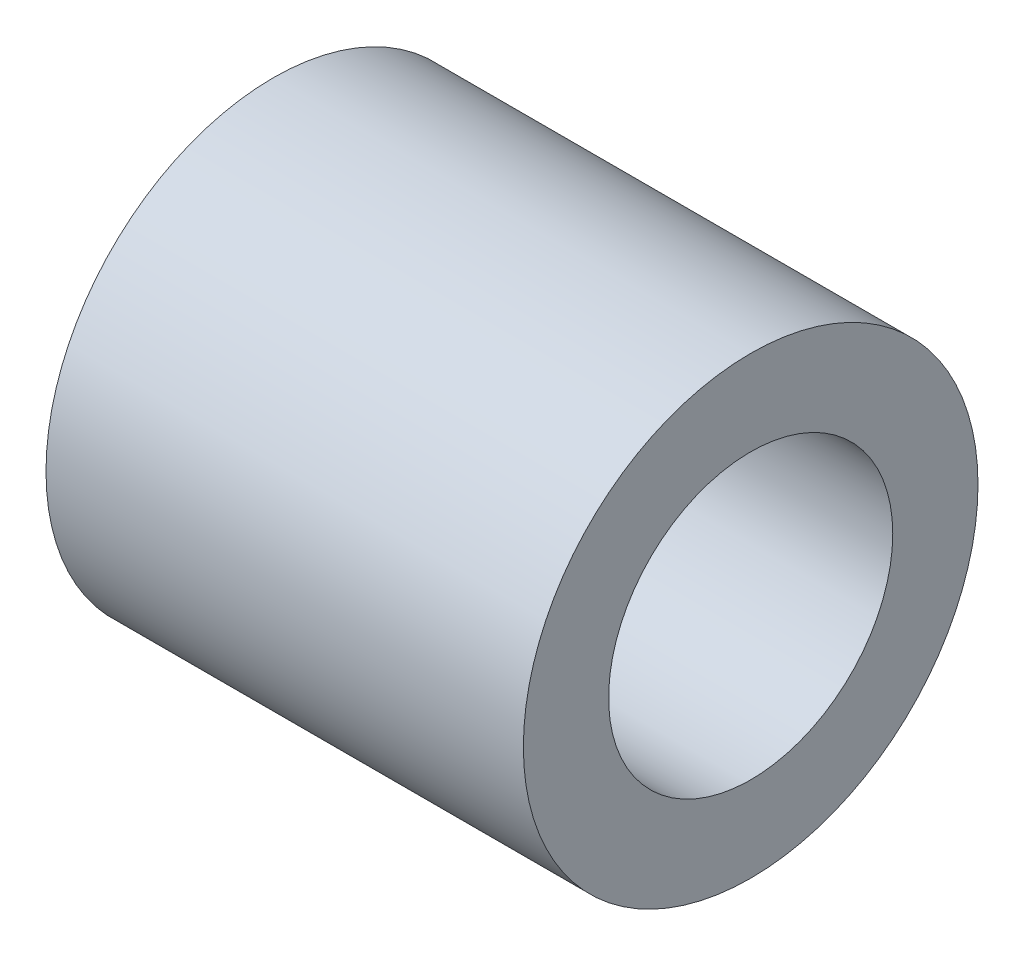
ISO-10303-21;
HEADER;
FILE_DESCRIPTION(('STEP AP214'),'2;1');
FILE_NAME('part.step','',(''),(''),'','','');
FILE_SCHEMA(('AUTOMOTIVE_DESIGN { 1 0 10303 214 1 1 1 1 }'));
ENDSEC;
DATA;
#1=APPLICATION_CONTEXT('core data for automotive mechanical design processes');
#2=APPLICATION_PROTOCOL_DEFINITION('international standard','automotive_design',2000,#1);
#3=PRODUCT_CONTEXT('',#1,'mechanical');
#4=PRODUCT('Part','Part','',(#3));
#5=PRODUCT_RELATED_PRODUCT_CATEGORY('part','',(#4));
#6=PRODUCT_DEFINITION_FORMATION('','',#4);
#7=PRODUCT_DEFINITION_CONTEXT('part definition',#1,'design');
#8=PRODUCT_DEFINITION('design','',#6,#7);
#9=PRODUCT_DEFINITION_SHAPE('','',#8);
#10=(LENGTH_UNIT() NAMED_UNIT(*) SI_UNIT(.MILLI.,.METRE.));
#11=(NAMED_UNIT(*) PLANE_ANGLE_UNIT() SI_UNIT($,.RADIAN.));
#12=(NAMED_UNIT(*) SI_UNIT($,.STERADIAN.) SOLID_ANGLE_UNIT());
#13=UNCERTAINTY_MEASURE_WITH_UNIT(LENGTH_MEASURE(1.E-05),#10,'distance_accuracy_value','');
#14=(GEOMETRIC_REPRESENTATION_CONTEXT(3) GLOBAL_UNCERTAINTY_ASSIGNED_CONTEXT((#13)) GLOBAL_UNIT_ASSIGNED_CONTEXT((#10,
#11,#12)) REPRESENTATION_CONTEXT('',''));
#15=CARTESIAN_POINT('',(0.,0.,0.));
#16=DIRECTION('',(0.,0.,1.));
#17=DIRECTION('',(1.,0.,0.));
#18=AXIS2_PLACEMENT_3D('',#15,#16,#17);
#19=CARTESIAN_POINT('',(4.1,0.,0.));
#20=DIRECTION('',(-1.,0.,0.));
#21=DIRECTION('',(0.,0.,1.));
#22=AXIS2_PLACEMENT_3D('',#19,#20,#21);
#23=CYLINDRICAL_SURFACE('',#22,2.);
#24=CARTESIAN_POINT('',(4.1,0.,0.));
#25=DIRECTION('',(1.,0.,0.));
#26=DIRECTION('',(0.,0.,-1.));
#27=AXIS2_PLACEMENT_3D('',#24,#25,#26);
#28=CIRCLE('',#27,2.);
#29=CARTESIAN_POINT('',(4.1,0.,-2.));
#30=VERTEX_POINT('',#29);
#31=EDGE_CURVE('E10',#30,#30,#28,.T.);
#32=ORIENTED_EDGE('',*,*,#31,.F.);
#33=EDGE_LOOP('',(#32));
#34=FACE_BOUND('',#33,.T.);
#35=CARTESIAN_POINT('',(-0.1,0.,0.));
#36=DIRECTION('',(1.,0.,0.));
#37=DIRECTION('',(0.,0.,-1.));
#38=AXIS2_PLACEMENT_3D('',#35,#36,#37);
#39=CIRCLE('',#38,2.);
#40=CARTESIAN_POINT('',(-0.1,0.,-2.));
#41=VERTEX_POINT('',#40);
#42=EDGE_CURVE('E39',#41,#41,#39,.T.);
#43=ORIENTED_EDGE('',*,*,#42,.T.);
#44=EDGE_LOOP('',(#43));
#45=FACE_BOUND('',#44,.T.);
#46=ADVANCED_FACE('F33',(#34,#45),#23,.T.);
#47=CARTESIAN_POINT('',(4.1,0.,0.));
#48=DIRECTION('',(1.,0.,0.));
#49=DIRECTION('',(0.,0.,-1.));
#50=AXIS2_PLACEMENT_3D('',#47,#48,#49);
#51=PLANE('',#50);
#52=CARTESIAN_POINT('',(4.1,0.,0.));
#53=DIRECTION('',(1.,0.,0.));
#54=DIRECTION('',(0.,0.,-1.));
#55=AXIS2_PLACEMENT_3D('',#52,#53,#54);
#56=CIRCLE('',#55,1.25);
#57=CARTESIAN_POINT('',(4.1,0.,-1.25));
#58=VERTEX_POINT('',#57);
#59=EDGE_CURVE('E43',#58,#58,#56,.T.);
#60=ORIENTED_EDGE('',*,*,#59,.F.);
#61=EDGE_LOOP('',(#60));
#62=FACE_BOUND('',#61,.T.);
#63=ORIENTED_EDGE('',*,*,#31,.T.);
#64=EDGE_LOOP('',(#63));
#65=FACE_BOUND('',#64,.T.);
#66=ADVANCED_FACE('F58',(#62,#65),#51,.T.);
#67=CARTESIAN_POINT('',(-0.1,0.,0.));
#68=DIRECTION('',(1.,0.,0.));
#69=DIRECTION('',(0.,0.,-1.));
#70=AXIS2_PLACEMENT_3D('',#67,#68,#69);
#71=PLANE('',#70);
#72=CARTESIAN_POINT('',(-0.1,0.,0.));
#73=DIRECTION('',(1.,0.,0.));
#74=DIRECTION('',(0.,0.,-1.));
#75=AXIS2_PLACEMENT_3D('',#72,#73,#74);
#76=CIRCLE('',#75,1.25);
#77=CARTESIAN_POINT('',(-0.1,0.,-1.25));
#78=VERTEX_POINT('',#77);
#79=EDGE_CURVE('E47',#78,#78,#76,.F.);
#80=ORIENTED_EDGE('',*,*,#79,.F.);
#81=EDGE_LOOP('',(#80));
#82=FACE_BOUND('',#81,.T.);
#83=ORIENTED_EDGE('',*,*,#42,.F.);
#84=EDGE_LOOP('',(#83));
#85=FACE_BOUND('',#84,.T.);
#86=ADVANCED_FACE('F55',(#82,#85),#71,.F.);
#87=CARTESIAN_POINT('',(4.101,0.,0.));
#88=DIRECTION('',(-1.,0.,0.));
#89=DIRECTION('',(0.,0.,1.));
#90=AXIS2_PLACEMENT_3D('',#87,#88,#89);
#91=CYLINDRICAL_SURFACE('',#90,1.25);
#92=ORIENTED_EDGE('',*,*,#59,.T.);
#93=EDGE_LOOP('',(#92));
#94=FACE_BOUND('',#93,.T.);
#95=ORIENTED_EDGE('',*,*,#79,.T.);
#96=EDGE_LOOP('',(#95));
#97=FACE_BOUND('',#96,.T.);
#98=ADVANCED_FACE('F53',(#94,#97),#91,.F.);
#99=CLOSED_SHELL('',(#46,#66,#86,#98));
#100=MANIFOLD_SOLID_BREP('B2',#99);
#101=ADVANCED_BREP_SHAPE_REPRESENTATION('',(#18,#100),#14);
#102=SHAPE_DEFINITION_REPRESENTATION(#9,#101);
ENDSEC;
END-ISO-10303-21;
